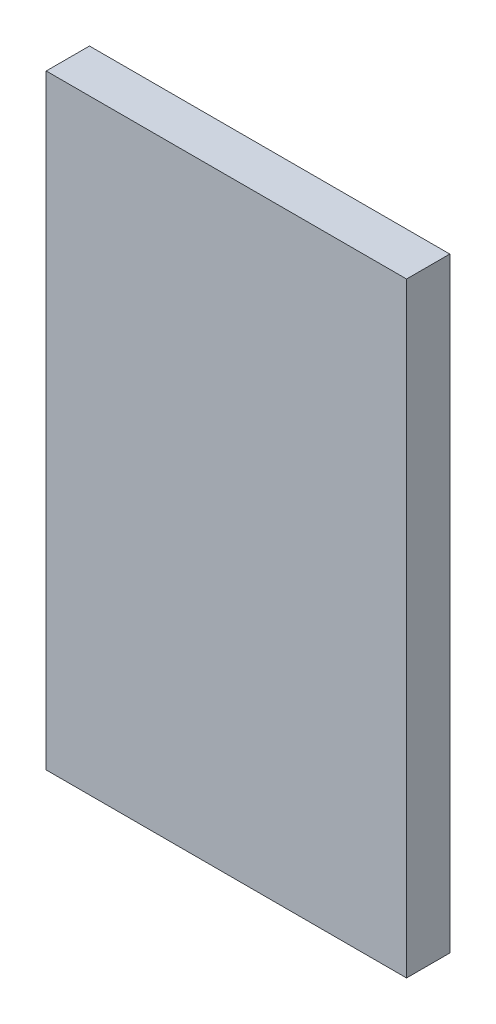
from build123d import *

# Parameters (mm, degrees)
ESQUISSE1_W        = 250
ESQUISSE1_H        = 420
BOSS_EXTRU_1_DEPTH = 30


with BuildPart() as part:
    # Esquisse1 → Boss.-Extru.1 (new body)
    with BuildSketch(Plane.XY):
        with Locations((125, 210)):
            Rectangle(ESQUISSE1_W, ESQUISSE1_H)
    extrude(amount=BOSS_EXTRU_1_DEPTH)


solid = part.part
